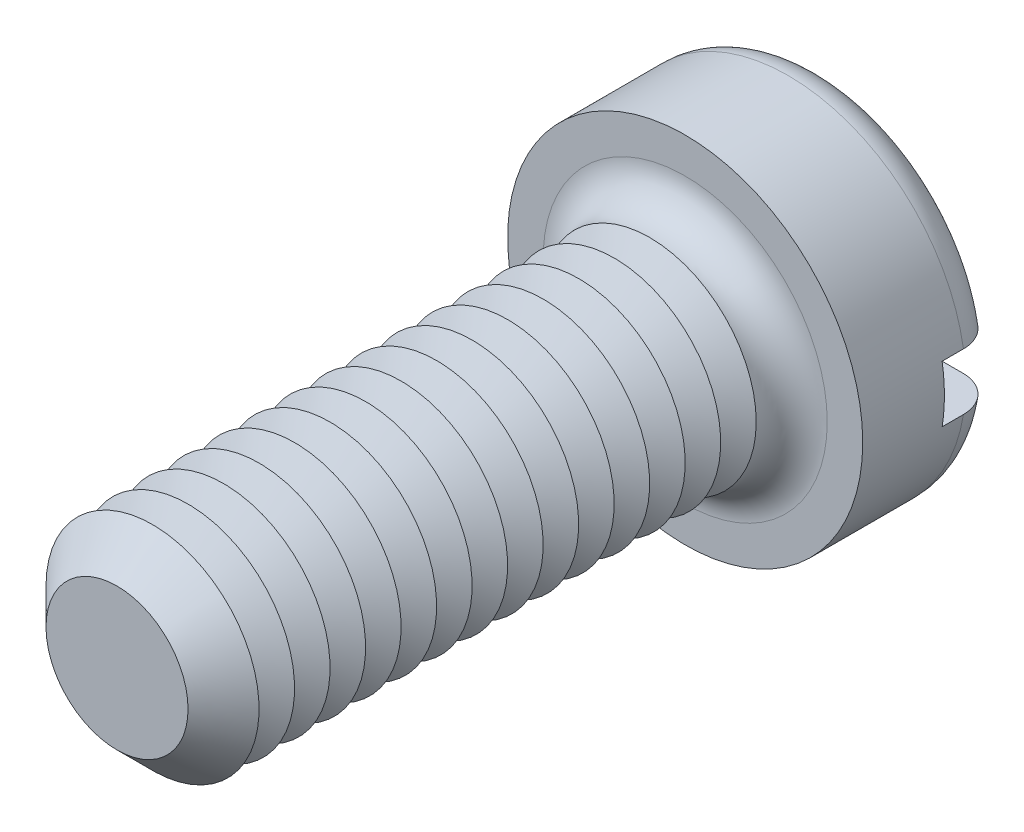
ISO-10303-21;
HEADER;
FILE_DESCRIPTION(('STEP AP214'),'2;1');
FILE_NAME('part.step','',(''),(''),'','','');
FILE_SCHEMA(('AUTOMOTIVE_DESIGN { 1 0 10303 214 1 1 1 1 }'));
ENDSEC;
DATA;
#1=APPLICATION_CONTEXT('core data for automotive mechanical design processes');
#2=APPLICATION_PROTOCOL_DEFINITION('international standard','automotive_design',2000,#1);
#3=PRODUCT_CONTEXT('',#1,'mechanical');
#4=PRODUCT('Part','Part','',(#3));
#5=PRODUCT_RELATED_PRODUCT_CATEGORY('part','',(#4));
#6=PRODUCT_DEFINITION_FORMATION('','',#4);
#7=PRODUCT_DEFINITION_CONTEXT('part definition',#1,'design');
#8=PRODUCT_DEFINITION('design','',#6,#7);
#9=PRODUCT_DEFINITION_SHAPE('','',#8);
#10=(LENGTH_UNIT() NAMED_UNIT(*) SI_UNIT(.MILLI.,.METRE.));
#11=(NAMED_UNIT(*) PLANE_ANGLE_UNIT() SI_UNIT($,.RADIAN.));
#12=(NAMED_UNIT(*) SI_UNIT($,.STERADIAN.) SOLID_ANGLE_UNIT());
#13=UNCERTAINTY_MEASURE_WITH_UNIT(LENGTH_MEASURE(1.E-05),#10,'distance_accuracy_value','');
#14=(GEOMETRIC_REPRESENTATION_CONTEXT(3) GLOBAL_UNCERTAINTY_ASSIGNED_CONTEXT((#13)) GLOBAL_UNIT_ASSIGNED_CONTEXT((#10,
#11,#12)) REPRESENTATION_CONTEXT('',''));
#15=CARTESIAN_POINT('',(0.,0.,0.));
#16=DIRECTION('',(0.,0.,1.));
#17=DIRECTION('',(1.,0.,0.));
#18=AXIS2_PLACEMENT_3D('',#15,#16,#17);
#19=CARTESIAN_POINT('',(0.,0.,-3.9));
#20=DIRECTION('',(0.,0.,1.));
#21=DIRECTION('',(1.,0.,0.));
#22=AXIS2_PLACEMENT_3D('',#19,#20,#21);
#23=PLANE('',#22);
#24=CARTESIAN_POINT('',(0.,0.,-3.9));
#25=DIRECTION('',(0.,0.,1.));
#26=DIRECTION('',(1.,0.,0.));
#27=AXIS2_PLACEMENT_3D('',#24,#25,#26);
#28=CIRCLE('',#27,4.);
#29=CARTESIAN_POINT('',(-3.91918358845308,0.800000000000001,-3.9));
#30=VERTEX_POINT('',#29);
#31=CARTESIAN_POINT('',(3.91918358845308,0.8,-3.9));
#32=VERTEX_POINT('',#31);
#33=EDGE_CURVE('E116',#30,#32,#28,.F.);
#34=ORIENTED_EDGE('',*,*,#33,.T.);
#35=DIRECTION('',(1.,0.,0.));
#36=VECTOR('',#35,1.);
#37=CARTESIAN_POINT('',(-5.,0.800000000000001,-3.9));
#38=LINE('',#37,#36);
#39=EDGE_CURVE('E111',#30,#32,#38,.T.);
#40=ORIENTED_EDGE('',*,*,#39,.F.);
#41=EDGE_LOOP('',(#34,#40));
#42=FACE_BOUND('',#41,.T.);
#43=ADVANCED_FACE('F39',(#42),#23,.F.);
#44=CARTESIAN_POINT('',(0.,0.,-2.9));
#45=DIRECTION('',(0.,0.,1.));
#46=DIRECTION('',(1.,0.,0.));
#47=AXIS2_PLACEMENT_3D('',#44,#45,#46);
#48=TOROIDAL_SURFACE('',#47,4.,1.);
#49=CARTESIAN_POINT('',(-4.76648512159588,0.800000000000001,-3.45304061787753));
#50=CARTESIAN_POINT('',(-4.73486405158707,0.800000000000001,-3.50001565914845));
#51=CARTESIAN_POINT('',(-4.69920787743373,0.800000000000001,-3.54432871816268));
#52=CARTESIAN_POINT('',(-4.62090302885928,0.800000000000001,-3.62634638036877));
#53=CARTESIAN_POINT('',(-4.57824494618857,0.800000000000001,-3.66404194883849));
#54=CARTESIAN_POINT('',(-4.48726975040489,0.800000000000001,-3.73172278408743));
#55=CARTESIAN_POINT('',(-4.43895902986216,0.800000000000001,-3.76171664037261));
#56=CARTESIAN_POINT('',(-4.33804923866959,0.800000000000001,-3.81326437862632));
#57=CARTESIAN_POINT('',(-4.2854512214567,0.800000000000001,-3.8348203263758));
#58=CARTESIAN_POINT('',(-4.17679895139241,0.800000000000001,-3.86918431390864));
#59=CARTESIAN_POINT('',(-4.12071163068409,0.800000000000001,-3.88188775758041));
#60=CARTESIAN_POINT('',(-4.00720729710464,0.800000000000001,-3.89785932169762));
#61=CARTESIAN_POINT('',(-3.94979011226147,0.800000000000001,-3.9011262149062));
#62=CARTESIAN_POINT('',(-3.83429042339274,0.800000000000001,-3.89816676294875));
#63=CARTESIAN_POINT('',(-3.77621176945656,0.800000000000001,-3.89178937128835));
#64=CARTESIAN_POINT('',(-3.66191938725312,0.800000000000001,-3.8694726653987));
#65=CARTESIAN_POINT('',(-3.60570580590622,0.800000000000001,-3.85353259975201));
#66=CARTESIAN_POINT('',(-3.49618749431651,0.800000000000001,-3.81233202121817));
#67=CARTESIAN_POINT('',(-3.44291561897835,0.800000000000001,-3.78698406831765));
#68=CARTESIAN_POINT('',(-3.34140774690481,0.800000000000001,-3.72766098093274));
#69=CARTESIAN_POINT('',(-3.29317182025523,0.800000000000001,-3.69368572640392));
#70=CARTESIAN_POINT('',(-3.20343355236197,0.800000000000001,-3.6182054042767));
#71=CARTESIAN_POINT('',(-3.16189680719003,0.800000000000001,-3.57674128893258));
#72=CARTESIAN_POINT('',(-3.08658236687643,0.800000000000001,-3.48727547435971));
#73=CARTESIAN_POINT('',(-3.05280364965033,0.800000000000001,-3.43927463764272));
#74=CARTESIAN_POINT('',(-2.99489532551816,0.800000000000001,-3.33932895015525));
#75=CARTESIAN_POINT('',(-2.97055012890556,0.800000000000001,-3.28750911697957));
#76=CARTESIAN_POINT('',(-2.93124252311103,0.800000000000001,-3.18042600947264));
#77=CARTESIAN_POINT('',(-2.91627793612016,0.800000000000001,-3.12516353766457));
#78=CARTESIAN_POINT('',(-2.89663075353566,0.800000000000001,-3.01470560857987));
#79=CARTESIAN_POINT('',(-2.89162828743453,0.800000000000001,-2.95956691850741));
#80=CARTESIAN_POINT('',(-2.89112479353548,0.800000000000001,-2.84924961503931));
#81=CARTESIAN_POINT('',(-2.89562264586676,0.800000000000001,-2.79407100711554));
#82=CARTESIAN_POINT('',(-2.91379565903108,0.800000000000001,-2.6861912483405));
#83=CARTESIAN_POINT('',(-2.92731815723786,0.800000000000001,-2.63346424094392));
#84=CARTESIAN_POINT('',(-2.96290888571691,0.800000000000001,-2.53098203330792));
#85=CARTESIAN_POINT('',(-2.98497757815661,0.800000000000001,-2.48122699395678));
#86=CARTESIAN_POINT('',(-3.03728055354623,0.800000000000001,-2.38535286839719));
#87=CARTESIAN_POINT('',(-3.06761989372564,0.800000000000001,-2.33929117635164));
#88=CARTESIAN_POINT('',(-3.13537950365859,0.800000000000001,-2.2527125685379));
#89=CARTESIAN_POINT('',(-3.17280082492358,0.800000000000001,-2.21219647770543));
#90=CARTESIAN_POINT('',(-3.2549164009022,0.800000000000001,-2.13651195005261));
#91=CARTESIAN_POINT('',(-3.29980186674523,0.800000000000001,-2.10155095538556));
#92=CARTESIAN_POINT('',(-3.39467666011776,0.800000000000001,-2.03942270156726));
#93=CARTESIAN_POINT('',(-3.44466673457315,0.800000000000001,-2.01225658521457));
#94=CARTESIAN_POINT('',(-3.5497933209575,0.800000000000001,-1.96576935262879));
#95=CARTESIAN_POINT('',(-3.60503228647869,0.800000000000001,-1.94667963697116));
#96=CARTESIAN_POINT('',(-3.71791613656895,0.800000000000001,-1.91794308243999));
#97=CARTESIAN_POINT('',(-3.77556119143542,0.800000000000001,-1.90829691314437));
#98=CARTESIAN_POINT('',(-3.89221522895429,0.800000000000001,-1.89869331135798));
#99=CARTESIAN_POINT('',(-3.9512319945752,0.800000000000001,-1.89882985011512));
#100=CARTESIAN_POINT('',(-4.06839541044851,0.800000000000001,-1.90907818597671));
#101=CARTESIAN_POINT('',(-4.12654207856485,0.800000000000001,-1.91918977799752));
#102=CARTESIAN_POINT('',(-4.23988103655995,0.800000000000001,-1.9490667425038));
#103=CARTESIAN_POINT('',(-4.29509069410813,0.800000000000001,-1.96876615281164));
#104=CARTESIAN_POINT('',(-4.40134194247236,0.800000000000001,-2.01729572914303));
#105=CARTESIAN_POINT('',(-4.45238383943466,0.800000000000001,-2.04612522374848));
#106=CARTESIAN_POINT('',(-4.54801343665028,0.800000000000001,-2.1116316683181));
#107=CARTESIAN_POINT('',(-4.59268768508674,0.800000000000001,-2.14818225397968));
#108=CARTESIAN_POINT('',(-4.67513924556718,0.800000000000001,-2.22837632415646));
#109=CARTESIAN_POINT('',(-4.71291715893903,0.800000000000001,-2.27201918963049));
#110=CARTESIAN_POINT('',(-4.77986554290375,0.800000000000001,-2.36439990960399));
#111=CARTESIAN_POINT('',(-4.80916462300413,0.800000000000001,-2.41304457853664));
#112=CARTESIAN_POINT('',(-4.85906149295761,0.800000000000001,-2.51460659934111));
#113=CARTESIAN_POINT('',(-4.8796602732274,0.800000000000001,-2.56752346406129));
#114=CARTESIAN_POINT('',(-4.9113264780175,0.800000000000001,-2.67542592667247));
#115=CARTESIAN_POINT('',(-4.92250819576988,0.800000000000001,-2.73037800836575));
#116=CARTESIAN_POINT('',(-4.93542682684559,0.800000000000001,-2.84139649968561));
#117=CARTESIAN_POINT('',(-4.93716171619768,0.800000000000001,-2.89746314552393));
#118=CARTESIAN_POINT('',(-4.93114851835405,0.800000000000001,-3.00876455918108));
#119=CARTESIAN_POINT('',(-4.92345325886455,0.800000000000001,-3.0640022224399));
#120=CARTESIAN_POINT('',(-4.8989032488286,0.800000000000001,-3.17235240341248));
#121=CARTESIAN_POINT('',(-4.88205998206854,0.800000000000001,-3.22546749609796));
#122=CARTESIAN_POINT('',(-4.84819200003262,0.800000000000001,-3.30764066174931));
#123=CARTESIAN_POINT('',(-4.83390853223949,0.800000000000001,-3.33785845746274));
#124=CARTESIAN_POINT('',(-4.80237957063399,0.800000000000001,-3.39670633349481));
#125=CARTESIAN_POINT('',(-4.78513409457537,0.800000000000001,-3.42533642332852));
#126=CARTESIAN_POINT('',(-4.76648512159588,0.800000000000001,-3.45304061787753));
#127=B_SPLINE_CURVE_WITH_KNOTS('',3,(#49,#50,#51,#52,#53,#54,#55,#56,#57,#58,#59,#60,#61,#62,
#63,#64,#65,#66,#67,#68,#69,#70,#71,#72,#73,#74,#75,#76,#77,#78,#79,#80,#81,#82,#83,#84,#85,#86,
#87,#88,#89,#90,#91,#92,#93,#94,#95,#96,#97,#98,#99,#100,#101,#102,#103,#104,#105,#106,#107,
#108,#109,#110,#111,#112,#113,#114,#115,#116,#117,#118,#119,#120,#121,#122,#123,#124,#125,#126),
.UNSPECIFIED.,.T.,.F.,(4,2,2,2,2,2,2,2,2,2,2,2,2,2,2,2,2,2,2,2,2,2,2,2,2,2,2,2,2,2,2,2,2,2,2,2,
2,2,4),(0.,0.169755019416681,0.339740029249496,0.509534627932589,0.67928763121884,
0.851013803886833,1.02276230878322,1.19722869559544,1.37170879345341,1.54785292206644,
1.72399950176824,1.89921049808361,2.07439839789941,2.24530597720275,2.41617386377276,
2.58146078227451,2.74672821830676,2.90926852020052,3.0718176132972,3.2365363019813,
3.40127946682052,3.57118676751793,3.74111896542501,3.91563534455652,4.09016409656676,
4.26636956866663,4.4425714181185,4.61757781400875,4.79257134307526,4.96489650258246,
5.13720662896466,5.30674670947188,5.47626748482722,5.64369988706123,5.81116816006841,
5.97770254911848,6.14402836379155,6.24414438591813,6.34425980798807),.UNSPECIFIED.);
#128=CARTESIAN_POINT('',(-4.93558507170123,0.800000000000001,-2.9));
#129=VERTEX_POINT('',#128);
#130=EDGE_CURVE('E290',#129,#30,#127,.T.);
#131=ORIENTED_EDGE('',*,*,#130,.F.);
#132=CARTESIAN_POINT('',(0.,0.,-2.9));
#133=DIRECTION('',(0.,0.,1.));
#134=DIRECTION('',(1.,0.,0.));
#135=AXIS2_PLACEMENT_3D('',#132,#133,#134);
#136=CIRCLE('',#135,5.);
#137=CARTESIAN_POINT('',(4.93558507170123,0.8,-2.9));
#138=VERTEX_POINT('',#137);
#139=EDGE_CURVE('E124',#138,#129,#136,.T.);
#140=ORIENTED_EDGE('',*,*,#139,.F.);
#141=CARTESIAN_POINT('',(2.98553785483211,0.8,-3.31649797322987));
#142=CARTESIAN_POINT('',(3.00991125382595,0.8,-3.36788093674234));
#143=CARTESIAN_POINT('',(3.03875556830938,0.8,-3.41719756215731));
#144=CARTESIAN_POINT('',(3.1043993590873,0.8,-3.51028676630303));
#145=CARTESIAN_POINT('',(3.1412115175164,0.8,-3.55405032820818));
#146=CARTESIAN_POINT('',(3.22153641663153,0.8,-3.63476402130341));
#147=CARTESIAN_POINT('',(3.26503706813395,0.8,-3.67172618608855));
#148=CARTESIAN_POINT('',(3.35749627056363,0.8,-3.73799476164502));
#149=CARTESIAN_POINT('',(3.4064533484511,0.8,-3.76730323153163));
#150=CARTESIAN_POINT('',(3.5095773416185,0.8,-3.81809642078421));
#151=CARTESIAN_POINT('',(3.56383317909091,0.8,-3.83940072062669));
#152=CARTESIAN_POINT('',(3.67513017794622,0.8,-3.87272481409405));
#153=CARTESIAN_POINT('',(3.7321717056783,0.8,-3.88474338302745));
#154=CARTESIAN_POINT('',(3.84815688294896,0.8,-3.89923413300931));
#155=CARTESIAN_POINT('',(3.90711516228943,0.8,-3.9015896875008));
#156=CARTESIAN_POINT('',(4.02458610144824,0.8,-3.89631753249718));
#157=CARTESIAN_POINT('',(4.08309876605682,0.8,-3.8886899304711));
#158=CARTESIAN_POINT('',(4.19768646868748,0.8,-3.86366584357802));
#159=CARTESIAN_POINT('',(4.25377243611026,0.8,-3.84631948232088));
#160=CARTESIAN_POINT('',(4.3621676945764,0.8,-3.80231797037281));
#161=CARTESIAN_POINT('',(4.41447726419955,0.8,-3.77566350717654));
#162=CARTESIAN_POINT('',(4.51300872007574,0.8,-3.71421163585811));
#163=CARTESIAN_POINT('',(4.5593085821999,0.8,-3.67953927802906));
#164=CARTESIAN_POINT('',(4.64530675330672,0.8,-3.60279495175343));
#165=CARTESIAN_POINT('',(4.68500564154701,0.8,-3.56072363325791));
#166=CARTESIAN_POINT('',(4.75599202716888,0.8,-3.47111750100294));
#167=CARTESIAN_POINT('',(4.7874061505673,0.8,-3.42368298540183));
#168=CARTESIAN_POINT('',(4.84170328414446,0.8,-3.32415927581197));
#169=CARTESIAN_POINT('',(4.86458695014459,0.8,-3.2720704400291));
#170=CARTESIAN_POINT('',(4.90088120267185,0.8,-3.16544016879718));
#171=CARTESIAN_POINT('',(4.91440984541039,0.8,-3.11093889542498));
#172=CARTESIAN_POINT('',(4.93205429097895,0.8,-3.00043391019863));
#173=CARTESIAN_POINT('',(4.93617053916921,0.8,-2.9444302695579));
#174=CARTESIAN_POINT('',(4.93486973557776,0.8,-2.83292218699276));
#175=CARTESIAN_POINT('',(4.92951827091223,0.8,-2.77741696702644));
#176=CARTESIAN_POINT('',(4.90957104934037,0.8,-2.66809456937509));
#177=CARTESIAN_POINT('',(4.89497541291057,0.8,-2.61427736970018));
#178=CARTESIAN_POINT('',(4.85697876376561,0.8,-2.50985095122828));
#179=CARTESIAN_POINT('',(4.83357805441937,0.8,-2.45924162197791));
#180=CARTESIAN_POINT('',(4.77866660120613,0.8,-2.36263484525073));
#181=CARTESIAN_POINT('',(4.74715567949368,0.8,-2.31663749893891));
#182=CARTESIAN_POINT('',(4.67670791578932,0.8,-2.23021464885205));
#183=CARTESIAN_POINT('',(4.6377224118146,0.8,-2.1898288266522));
#184=CARTESIAN_POINT('',(4.55359880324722,0.8,-2.11607828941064));
#185=CARTESIAN_POINT('',(4.50846036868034,0.8,-2.08271395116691));
#186=CARTESIAN_POINT('',(4.41271544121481,0.8,-2.02349513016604));
#187=CARTESIAN_POINT('',(4.36204749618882,0.8,-1.99774003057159));
#188=CARTESIAN_POINT('',(4.257155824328,0.8,-1.95495040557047));
#189=CARTESIAN_POINT('',(4.20293181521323,0.8,-1.93791657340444));
#190=CARTESIAN_POINT('',(4.09154156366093,0.8,-1.91276335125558));
#191=CARTESIAN_POINT('',(4.03434212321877,0.8,-1.90479098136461));
#192=CARTESIAN_POINT('',(3.91941228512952,0.8,-1.89840884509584));
#193=CARTESIAN_POINT('',(3.8616818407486,0.8,-1.89999992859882));
#194=CARTESIAN_POINT('',(3.7464111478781,0.8,-1.91275144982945));
#195=CARTESIAN_POINT('',(3.6888866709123,0.8,-1.92405471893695));
#196=CARTESIAN_POINT('',(3.57652290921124,0.8,-1.95609086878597));
#197=CARTESIAN_POINT('',(3.52168382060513,0.8,-1.97682443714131));
#198=CARTESIAN_POINT('',(3.41589179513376,0.8,-2.02733294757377));
#199=CARTESIAN_POINT('',(3.36496676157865,0.8,-2.05716640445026));
#200=CARTESIAN_POINT('',(3.26890903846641,0.8,-2.12504079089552));
#201=CARTESIAN_POINT('',(3.22377627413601,0.8,-2.16308161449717));
#202=CARTESIAN_POINT('',(3.141135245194,0.8,-2.24593284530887));
#203=CARTESIAN_POINT('',(3.1035541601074,0.8,-2.29067053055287));
#204=CARTESIAN_POINT('',(3.03669700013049,0.8,-2.38597317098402));
#205=CARTESIAN_POINT('',(3.00741914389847,0.8,-2.43653687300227));
#206=CARTESIAN_POINT('',(2.95891799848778,0.8,-2.54052959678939));
#207=CARTESIAN_POINT('',(2.93943249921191,0.8,-2.59383627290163));
#208=CARTESIAN_POINT('',(2.9100081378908,0.8,-2.70303736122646));
#209=CARTESIAN_POINT('',(2.90006970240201,0.8,-2.75893188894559));
#210=CARTESIAN_POINT('',(2.89027863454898,0.8,-2.86986958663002));
#211=CARTESIAN_POINT('',(2.89012791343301,0.8,-2.92488680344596));
#212=CARTESIAN_POINT('',(2.89917145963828,0.8,-3.03409648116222));
#213=CARTESIAN_POINT('',(2.90835313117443,0.8,-3.08828995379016));
#214=CARTESIAN_POINT('',(2.92977618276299,0.8,-3.17141652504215));
#215=CARTESIAN_POINT('',(2.93899011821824,0.8,-3.20116372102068));
#216=CARTESIAN_POINT('',(2.96020249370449,0.8,-3.25964614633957));
#217=CARTESIAN_POINT('',(2.97220082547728,0.8,-3.28838141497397));
#218=CARTESIAN_POINT('',(2.98553785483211,0.8,-3.31649797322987));
#219=B_SPLINE_CURVE_WITH_KNOTS('',3,(#141,#142,#143,#144,#145,#146,#147,#148,#149,#150,#151,
#152,#153,#154,#155,#156,#157,#158,#159,#160,#161,#162,#163,#164,#165,#166,#167,#168,#169,#170,
#171,#172,#173,#174,#175,#176,#177,#178,#179,#180,#181,#182,#183,#184,#185,#186,#187,#188,#189,
#190,#191,#192,#193,#194,#195,#196,#197,#198,#199,#200,#201,#202,#203,#204,#205,#206,#207,#208,
#209,#210,#211,#212,#213,#214,#215,#216,#217,#218),.UNSPECIFIED.,.T.,.F.,(4,2,2,2,2,2,2,2,2,2,2,
2,2,2,2,2,2,2,2,2,2,2,2,2,2,2,2,2,2,2,2,2,2,2,2,2,2,2,4),(0.,0.170493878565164,
0.341261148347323,0.511723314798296,0.682139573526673,0.856194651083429,1.03027268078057,
1.20644565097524,1.38261672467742,1.55788746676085,1.73314526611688,1.90583484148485,
2.07850925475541,2.24836742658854,2.41821253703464,2.58587311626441,2.75352576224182,
2.92002154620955,3.08651516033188,3.25300303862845,3.41949456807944,3.58710926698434,
3.75473295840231,3.92445790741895,4.09419634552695,4.26665110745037,4.43912119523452,
4.61417197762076,4.78923552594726,4.96544940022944,5.1416609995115,5.31608191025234,
5.49046537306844,5.65989063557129,5.82932346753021,5.99359365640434,6.157642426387,
6.250939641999,6.34423323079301),.UNSPECIFIED.);
#220=EDGE_CURVE('E292',#32,#138,#219,.T.);
#221=ORIENTED_EDGE('',*,*,#220,.F.);
#222=ORIENTED_EDGE('',*,*,#33,.F.);
#223=EDGE_LOOP('',(#131,#140,#221,#222));
#224=FACE_BOUND('',#223,.T.);
#225=ADVANCED_FACE('F274',(#224),#48,.T.);
#226=CARTESIAN_POINT('',(0.,0.,-3.9));
#227=DIRECTION('',(0.,0.,1.));
#228=DIRECTION('',(1.,0.,0.));
#229=AXIS2_PLACEMENT_3D('',#226,#227,#228);
#230=CYLINDRICAL_SURFACE('',#229,5.);
#231=DIRECTION('',(0.,0.,1.));
#232=VECTOR('',#231,1.);
#233=CARTESIAN_POINT('',(4.93558507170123,0.8,-3.9));
#234=LINE('',#233,#232);
#235=CARTESIAN_POINT('',(4.93558507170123,0.8,-2.3));
#236=VERTEX_POINT('',#235);
#237=EDGE_CURVE('E306',#138,#236,#234,.T.);
#238=ORIENTED_EDGE('',*,*,#237,.F.);
#239=ORIENTED_EDGE('',*,*,#139,.T.);
#240=DIRECTION('',(0.,0.,1.));
#241=VECTOR('',#240,1.);
#242=CARTESIAN_POINT('',(-4.93558507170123,0.800000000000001,-3.9));
#243=LINE('',#242,#241);
#244=CARTESIAN_POINT('',(-4.93558507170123,0.800000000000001,-2.3));
#245=VERTEX_POINT('',#244);
#246=EDGE_CURVE('E63',#245,#129,#243,.F.);
#247=ORIENTED_EDGE('',*,*,#246,.F.);
#248=CARTESIAN_POINT('',(0.,0.,-2.3));
#249=DIRECTION('',(0.,0.,-1.));
#250=DIRECTION('',(-1.,0.,0.));
#251=AXIS2_PLACEMENT_3D('',#248,#249,#250);
#252=CIRCLE('',#251,5.);
#253=CARTESIAN_POINT('',(-4.93558507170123,-0.799999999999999,-2.3));
#254=VERTEX_POINT('',#253);
#255=EDGE_CURVE('E43',#245,#254,#252,.F.);
#256=ORIENTED_EDGE('',*,*,#255,.T.);
#257=DIRECTION('',(0.,0.,1.));
#258=VECTOR('',#257,1.);
#259=CARTESIAN_POINT('',(-4.93558507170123,-0.799999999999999,-3.9));
#260=LINE('',#259,#258);
#261=CARTESIAN_POINT('',(-4.93558507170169,-0.799999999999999,-2.89999999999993));
#262=VERTEX_POINT('',#261);
#263=EDGE_CURVE('E304',#262,#254,#260,.T.);
#264=ORIENTED_EDGE('',*,*,#263,.F.);
#265=CARTESIAN_POINT('',(4.93558507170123,-0.8,-2.9));
#266=VERTEX_POINT('',#265);
#267=EDGE_CURVE('E126',#262,#266,#136,.T.);
#268=ORIENTED_EDGE('',*,*,#267,.T.);
#269=DIRECTION('',(0.,0.,1.));
#270=VECTOR('',#269,1.);
#271=CARTESIAN_POINT('',(4.93558507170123,-0.8,-3.9));
#272=LINE('',#271,#270);
#273=CARTESIAN_POINT('',(4.93558507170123,-0.8,-2.3));
#274=VERTEX_POINT('',#273);
#275=EDGE_CURVE('E55',#274,#266,#272,.F.);
#276=ORIENTED_EDGE('',*,*,#275,.F.);
#277=EDGE_CURVE('E11',#274,#236,#252,.F.);
#278=ORIENTED_EDGE('',*,*,#277,.T.);
#279=EDGE_LOOP('',(#238,#239,#247,#256,#264,#268,#276,#278));
#280=FACE_BOUND('',#279,.T.);
#281=CARTESIAN_POINT('',(0.,0.,0.));
#282=DIRECTION('',(0.,0.,1.));
#283=DIRECTION('',(1.,0.,0.));
#284=AXIS2_PLACEMENT_3D('',#281,#282,#283);
#285=CIRCLE('',#284,5.);
#286=CARTESIAN_POINT('',(5.,0.,0.));
#287=VERTEX_POINT('',#286);
#288=EDGE_CURVE('E309',#287,#287,#285,.T.);
#289=ORIENTED_EDGE('',*,*,#288,.F.);
#290=EDGE_LOOP('',(#289));
#291=FACE_BOUND('',#290,.T.);
#292=ADVANCED_FACE('F270',(#280,#291),#230,.T.);
#293=CARTESIAN_POINT('',(3.91918358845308,-0.8,-3.9));
#294=VERTEX_POINT('',#293);
#295=CARTESIAN_POINT('',(-3.91918358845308,-0.799999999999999,-3.9));
#296=VERTEX_POINT('',#295);
#297=EDGE_CURVE('E109',#294,#296,#28,.F.);
#298=ORIENTED_EDGE('',*,*,#297,.T.);
#299=DIRECTION('',(-1.,0.,0.));
#300=VECTOR('',#299,1.);
#301=CARTESIAN_POINT('',(-5.,-0.799999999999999,-3.9));
#302=LINE('',#301,#300);
#303=EDGE_CURVE('E96',#294,#296,#302,.T.);
#304=ORIENTED_EDGE('',*,*,#303,.F.);
#305=EDGE_LOOP('',(#298,#304));
#306=FACE_BOUND('',#305,.T.);
#307=ADVANCED_FACE('F108',(#306),#23,.F.);
#308=CARTESIAN_POINT('',(0.,0.,0.));
#309=DIRECTION('',(0.,0.,1.));
#310=DIRECTION('',(1.,0.,0.));
#311=AXIS2_PLACEMENT_3D('',#308,#309,#310);
#312=PLANE('',#311);
#313=CARTESIAN_POINT('',(0.,0.,0.));
#314=DIRECTION('',(0.,0.,1.));
#315=DIRECTION('',(1.,0.,0.));
#316=AXIS2_PLACEMENT_3D('',#313,#314,#315);
#317=CIRCLE('',#316,4.);
#318=CARTESIAN_POINT('',(4.,0.,0.));
#319=VERTEX_POINT('',#318);
#320=EDGE_CURVE('E115',#319,#319,#317,.F.);
#321=ORIENTED_EDGE('',*,*,#320,.T.);
#322=EDGE_LOOP('',(#321));
#323=FACE_BOUND('',#322,.T.);
#324=ORIENTED_EDGE('',*,*,#288,.T.);
#325=EDGE_LOOP('',(#324));
#326=FACE_BOUND('',#325,.T.);
#327=ADVANCED_FACE('F269',(#323,#326),#312,.T.);
#328=CARTESIAN_POINT('',(-4.76648512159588,-0.799999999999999,-3.45304061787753));
#329=CARTESIAN_POINT('',(-4.7975694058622,-0.799999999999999,-3.40685392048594));
#330=CARTESIAN_POINT('',(-4.82479903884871,-0.799999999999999,-3.35802740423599));
#331=CARTESIAN_POINT('',(-4.87070632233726,-0.799999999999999,-3.25646127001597));
#332=CARTESIAN_POINT('',(-4.8893747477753,-0.799999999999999,-3.20371750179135));
#333=CARTESIAN_POINT('',(-4.91756720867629,-0.799999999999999,-3.09584501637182));
#334=CARTESIAN_POINT('',(-4.92709302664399,-0.799999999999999,-3.04071676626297));
#335=CARTESIAN_POINT('',(-4.93671217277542,-0.799999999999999,-2.92965669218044));
#336=CARTESIAN_POINT('',(-4.93680767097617,-0.799999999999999,-2.87372505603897));
#337=CARTESIAN_POINT('',(-4.92758675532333,-0.799999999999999,-2.76284675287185));
#338=CARTESIAN_POINT('',(-4.91830421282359,-0.799999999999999,-2.70789726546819));
#339=CARTESIAN_POINT('',(-4.89065741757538,-0.799999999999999,-2.60033228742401));
#340=CARTESIAN_POINT('',(-4.87229291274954,-0.799999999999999,-2.54771686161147));
#341=CARTESIAN_POINT('',(-4.82699855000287,-0.799999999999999,-2.44622441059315));
#342=CARTESIAN_POINT('',(-4.80005659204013,-0.799999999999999,-2.39735278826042));
#343=CARTESIAN_POINT('',(-4.73841244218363,-0.799999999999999,-2.30477947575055));
#344=CARTESIAN_POINT('',(-4.70371003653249,-0.799999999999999,-2.26107792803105));
#345=CARTESIAN_POINT('',(-4.62724516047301,-0.799999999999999,-2.17969334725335));
#346=CARTESIAN_POINT('',(-4.58542787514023,-0.799999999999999,-2.14206183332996));
#347=CARTESIAN_POINT('',(-4.49614171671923,-0.799999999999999,-2.07424284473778));
#348=CARTESIAN_POINT('',(-4.44867251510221,-0.799999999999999,-2.04405580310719));
#349=CARTESIAN_POINT('',(-4.34875035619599,-0.799999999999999,-1.99153688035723));
#350=CARTESIAN_POINT('',(-4.29623870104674,-0.799999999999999,-1.96931670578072));
#351=CARTESIAN_POINT('',(-4.18826905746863,-0.799999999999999,-1.93384994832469));
#352=CARTESIAN_POINT('',(-4.1328108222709,-0.799999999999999,-1.92060411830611));
#353=CARTESIAN_POINT('',(-4.01956054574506,-0.799999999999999,-1.90323798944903));
#354=CARTESIAN_POINT('',(-3.96174522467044,-0.799999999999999,-1.89926947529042));
#355=CARTESIAN_POINT('',(-3.84625419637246,-0.799999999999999,-1.90095183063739));
#356=CARTESIAN_POINT('',(-3.78857850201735,-0.799999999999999,-1.90660355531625));
#357=CARTESIAN_POINT('',(-3.67415602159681,-0.799999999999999,-1.92748272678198));
#358=CARTESIAN_POINT('',(-3.61743328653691,-0.799999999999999,-1.94284216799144));
#359=CARTESIAN_POINT('',(-3.50734962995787,-0.799999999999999,-1.9828275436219));
#360=CARTESIAN_POINT('',(-3.4539889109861,-0.799999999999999,-2.00745403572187));
#361=CARTESIAN_POINT('',(-3.35197118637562,-0.799999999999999,-2.06542964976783));
#362=CARTESIAN_POINT('',(-3.30333217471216,-0.799999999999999,-2.0988104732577));
#363=CARTESIAN_POINT('',(-3.21244692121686,-0.799999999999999,-2.17337326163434));
#364=CARTESIAN_POINT('',(-3.17020039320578,-0.799999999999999,-2.21455487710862));
#365=CARTESIAN_POINT('',(-3.0940098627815,-0.799999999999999,-2.30296695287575));
#366=CARTESIAN_POINT('',(-3.05995540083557,-0.799999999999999,-2.35010211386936));
#367=CARTESIAN_POINT('',(-3.00053815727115,-0.799999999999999,-2.4495670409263));
#368=CARTESIAN_POINT('',(-2.97517362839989,-0.799999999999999,-2.50189576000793));
#369=CARTESIAN_POINT('',(-2.93470320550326,-0.799999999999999,-2.60853979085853));
#370=CARTESIAN_POINT('',(-2.91930557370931,-0.799999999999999,-2.66274437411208));
#371=CARTESIAN_POINT('',(-2.89812734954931,-0.799999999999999,-2.77299836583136));
#372=CARTESIAN_POINT('',(-2.89234481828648,-0.799999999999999,-2.82904740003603));
#373=CARTESIAN_POINT('',(-2.89064073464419,-0.799999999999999,-2.93970612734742));
#374=CARTESIAN_POINT('',(-2.89444549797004,-0.799999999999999,-2.99431180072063));
#375=CARTESIAN_POINT('',(-2.9112006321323,-0.799999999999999,-3.10209766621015));
#376=CARTESIAN_POINT('',(-2.9241507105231,-0.799999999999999,-3.1552779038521));
#377=CARTESIAN_POINT('',(-2.95868580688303,-0.799999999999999,-3.25858631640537));
#378=CARTESIAN_POINT('',(-2.98024709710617,-0.799999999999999,-3.30872244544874));
#379=CARTESIAN_POINT('',(-3.03128544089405,-0.799999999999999,-3.40478519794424));
#380=CARTESIAN_POINT('',(-3.06076335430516,-0.799999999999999,-3.45071136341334));
#381=CARTESIAN_POINT('',(-3.12753448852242,-0.799999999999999,-3.53826932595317));
#382=CARTESIAN_POINT('',(-3.16500083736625,-0.799999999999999,-3.57976901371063));
#383=CARTESIAN_POINT('',(-3.24617503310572,-0.799999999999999,-3.65613204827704));
#384=CARTESIAN_POINT('',(-3.28988388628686,-0.799999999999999,-3.69099432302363));
#385=CARTESIAN_POINT('',(-3.38380639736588,-0.799999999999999,-3.75424083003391));
#386=CARTESIAN_POINT('',(-3.43418287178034,-0.799999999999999,-3.78238342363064));
#387=CARTESIAN_POINT('',(-3.53887888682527,-0.799999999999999,-3.83000231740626));
#388=CARTESIAN_POINT('',(-3.59319889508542,-0.799999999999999,-3.84947758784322));
#389=CARTESIAN_POINT('',(-3.70539237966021,-0.799999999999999,-3.87954336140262));
#390=CARTESIAN_POINT('',(-3.76331464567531,-0.799999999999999,-3.88995217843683));
#391=CARTESIAN_POINT('',(-3.88008461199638,-0.799999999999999,-3.9009132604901));
#392=CARTESIAN_POINT('',(-3.93893230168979,-0.799999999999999,-3.9014656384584));
#393=CARTESIAN_POINT('',(-4.05594892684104,-0.799999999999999,-3.89264187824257));
#394=CARTESIAN_POINT('',(-4.11411702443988,-0.799999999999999,-3.88325457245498));
#395=CARTESIAN_POINT('',(-4.22802928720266,-0.799999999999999,-3.85472582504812));
#396=CARTESIAN_POINT('',(-4.28377297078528,-0.799999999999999,-3.83558245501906));
#397=CARTESIAN_POINT('',(-4.39054463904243,-0.799999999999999,-3.78829842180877));
#398=CARTESIAN_POINT('',(-4.44161887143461,-0.799999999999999,-3.76026208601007));
#399=CARTESIAN_POINT('',(-4.53818016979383,-0.799999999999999,-3.69589278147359));
#400=CARTESIAN_POINT('',(-4.58367442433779,-0.799999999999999,-3.65957066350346));
#401=CARTESIAN_POINT('',(-4.65208830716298,-0.799999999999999,-3.59453310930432));
#402=CARTESIAN_POINT('',(-4.67711825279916,-0.799999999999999,-3.56800018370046));
#403=CARTESIAN_POINT('',(-4.72414423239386,-0.799999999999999,-3.51236863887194));
#404=CARTESIAN_POINT('',(-4.74614029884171,-0.799999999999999,-3.48327004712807));
#405=CARTESIAN_POINT('',(-4.76648512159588,-0.799999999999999,-3.45304061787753));
#406=B_SPLINE_CURVE_WITH_KNOTS('',3,(#328,#329,#330,#331,#332,#333,#334,#335,#336,#337,#338,
#339,#340,#341,#342,#343,#344,#345,#346,#347,#348,#349,#350,#351,#352,#353,#354,#355,#356,#357,
#358,#359,#360,#361,#362,#363,#364,#365,#366,#367,#368,#369,#370,#371,#372,#373,#374,#375,#376,
#377,#378,#379,#380,#381,#382,#383,#384,#385,#386,#387,#388,#389,#390,#391,#392,#393,#394,#395,
#396,#397,#398,#399,#400,#401,#402,#403,#404,#405),.UNSPECIFIED.,.T.,.F.,(4,2,2,2,2,2,2,2,2,2,2,
2,2,2,2,2,2,2,2,2,2,2,2,2,2,2,2,2,2,2,2,2,2,2,2,2,2,2,4),(0.,0.166886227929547,
0.333951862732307,0.500984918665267,0.667979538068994,0.834373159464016,1.00077139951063,
1.16740542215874,1.33404403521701,1.50202999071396,1.67002571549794,1.84029248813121,
2.01057354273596,2.18362161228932,2.35668506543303,2.53215380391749,2.70763310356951,
2.88375684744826,3.05987270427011,3.23346085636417,3.40701408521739,3.57522519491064,
3.74340238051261,3.90683338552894,4.0702591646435,4.23323770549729,4.39623395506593,
4.56320691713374,4.7302068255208,4.90252468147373,5.07486300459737,5.25058028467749,
5.42629555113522,5.60220844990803,5.77815613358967,5.95211162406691,6.12584060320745,
6.23506966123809,6.34429754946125),.UNSPECIFIED.);
#407=EDGE_CURVE('E103',#296,#262,#406,.T.);
#408=ORIENTED_EDGE('',*,*,#407,.F.);
#409=ORIENTED_EDGE('',*,*,#297,.F.);
#410=CARTESIAN_POINT('',(2.98553785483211,-0.8,-3.31649797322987));
#411=CARTESIAN_POINT('',(2.96216773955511,-0.8,-3.26721849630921));
#412=CARTESIAN_POINT('',(2.94287503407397,-0.8,-3.21596872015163));
#413=CARTESIAN_POINT('',(2.91313258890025,-0.8,-3.11092723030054));
#414=CARTESIAN_POINT('',(2.9026902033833,-0.8,-3.0571334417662));
#415=CARTESIAN_POINT('',(2.89104377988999,-0.8,-2.94853922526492));
#416=CARTESIAN_POINT('',(2.88984130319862,-0.8,-2.89373862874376));
#417=CARTESIAN_POINT('',(2.89672585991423,-0.8,-2.78473646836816));
#418=CARTESIAN_POINT('',(2.90481120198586,-0.8,-2.73053479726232));
#419=CARTESIAN_POINT('',(2.92989134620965,-0.8,-2.62460092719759));
#420=CARTESIAN_POINT('',(2.94682969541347,-0.8,-2.57285532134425));
#421=CARTESIAN_POINT('',(2.9889990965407,-0.8,-2.47286425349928));
#422=CARTESIAN_POINT('',(3.01423103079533,-0.8,-2.42461916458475));
#423=CARTESIAN_POINT('',(3.07271536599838,-0.8,-2.33201565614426));
#424=CARTESIAN_POINT('',(3.10610710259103,-0.8,-2.28774532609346));
#425=CARTESIAN_POINT('',(3.17963417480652,-0.8,-2.205215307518));
#426=CARTESIAN_POINT('',(3.21977054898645,-0.8,-2.16695654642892));
#427=CARTESIAN_POINT('',(3.3070361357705,-0.8,-2.09624274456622));
#428=CARTESIAN_POINT('',(3.35434874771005,-0.8,-2.06401396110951));
#429=CARTESIAN_POINT('',(3.45361131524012,-0.8,-2.00773436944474));
#430=CARTESIAN_POINT('',(3.50556189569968,-0.8,-1.98368466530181));
#431=CARTESIAN_POINT('',(3.61398433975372,-0.8,-1.94389460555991));
#432=CARTESIAN_POINT('',(3.67053506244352,-0.8,-1.92836880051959));
#433=CARTESIAN_POINT('',(3.78543606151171,-0.8,-1.90696594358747));
#434=CARTESIAN_POINT('',(3.84378643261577,-0.8,-1.90108940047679));
#435=CARTESIAN_POINT('',(3.96100201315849,-0.8,-1.89918115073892));
#436=CARTESIAN_POINT('',(4.01986821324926,-0.8,-1.90320860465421));
#437=CARTESIAN_POINT('',(4.13606891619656,-0.8,-1.9211820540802));
#438=CARTESIAN_POINT('',(4.19340347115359,-0.8,-1.93512771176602));
#439=CARTESIAN_POINT('',(4.30434213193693,-0.8,-1.97243705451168));
#440=CARTESIAN_POINT('',(4.35797549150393,-0.8,-1.99571368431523));
#441=CARTESIAN_POINT('',(4.46048254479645,-0.8,-2.0510826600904));
#442=CARTESIAN_POINT('',(4.50935662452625,-0.8,-2.08317429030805));
#443=CARTESIAN_POINT('',(4.60012348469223,-0.8,-2.15471647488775));
#444=CARTESIAN_POINT('',(4.64211506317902,-0.8,-2.19404167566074));
#445=CARTESIAN_POINT('',(4.71877054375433,-0.8,-2.27928299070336));
#446=CARTESIAN_POINT('',(4.75343508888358,-0.8,-2.32519852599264));
#447=CARTESIAN_POINT('',(4.81388799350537,-0.8,-2.4215411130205));
#448=CARTESIAN_POINT('',(4.83980652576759,-0.8,-2.47188650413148));
#449=CARTESIAN_POINT('',(4.88271402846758,-0.8,-2.57624865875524));
#450=CARTESIAN_POINT('',(4.89970360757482,-0.8,-2.63026517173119));
#451=CARTESIAN_POINT('',(4.92409334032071,-0.8,-2.73978844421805));
#452=CARTESIAN_POINT('',(4.93159814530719,-0.8,-2.79527191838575));
#453=CARTESIAN_POINT('',(4.93713723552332,-0.8,-2.90670881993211));
#454=CARTESIAN_POINT('',(4.9351718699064,-0.8,-2.9626622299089));
#455=CARTESIAN_POINT('',(4.92186293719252,-0.8,-3.07317093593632));
#456=CARTESIAN_POINT('',(4.91056393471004,-0.8,-3.12773160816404));
#457=CARTESIAN_POINT('',(4.87898532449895,-0.8,-3.234187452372));
#458=CARTESIAN_POINT('',(4.85870572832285,-0.8,-3.28608262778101));
#459=CARTESIAN_POINT('',(4.80971634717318,-0.8,-3.38586723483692));
#460=CARTESIAN_POINT('',(4.78098824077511,-0.8,-3.43374766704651));
#461=CARTESIAN_POINT('',(4.71596686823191,-0.8,-3.52405937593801));
#462=CARTESIAN_POINT('',(4.67967336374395,-0.8,-3.56649048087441));
#463=CARTESIAN_POINT('',(4.60022577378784,-0.8,-3.64511036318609));
#464=CARTESIAN_POINT('',(4.5570143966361,-0.8,-3.6812412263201));
#465=CARTESIAN_POINT('',(4.4652099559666,-0.8,-3.7458530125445));
#466=CARTESIAN_POINT('',(4.41661654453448,-0.8,-3.77433344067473));
#467=CARTESIAN_POINT('',(4.31470683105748,-0.8,-3.82326981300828));
#468=CARTESIAN_POINT('',(4.26133399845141,-0.8,-3.84360800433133));
#469=CARTESIAN_POINT('',(4.15196444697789,-0.8,-3.87519515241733));
#470=CARTESIAN_POINT('',(4.09596750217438,-0.8,-3.88644332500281));
#471=CARTESIAN_POINT('',(3.98196469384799,-0.8,-3.89971870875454));
#472=CARTESIAN_POINT('',(3.92394096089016,-0.8,-3.901592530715));
#473=CARTESIAN_POINT('',(3.8083852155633,-0.8,-3.89570840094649));
#474=CARTESIAN_POINT('',(3.75085322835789,-0.8,-3.88794995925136));
#475=CARTESIAN_POINT('',(3.6371167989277,-0.8,-3.86287824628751));
#476=CARTESIAN_POINT('',(3.58093962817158,-0.8,-3.84544111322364));
#477=CARTESIAN_POINT('',(3.47227948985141,-0.8,-3.80139971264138));
#478=CARTESIAN_POINT('',(3.41979762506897,-0.8,-3.77479272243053));
#479=CARTESIAN_POINT('',(3.31994061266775,-0.8,-3.71304199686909));
#480=CARTESIAN_POINT('',(3.27257854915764,-0.8,-3.67787710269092));
#481=CARTESIAN_POINT('',(3.18459619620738,-0.8,-3.59999704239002));
#482=CARTESIAN_POINT('',(3.14396747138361,-0.8,-3.55729146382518));
#483=CARTESIAN_POINT('',(3.08341110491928,-0.8,-3.48140072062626));
#484=CARTESIAN_POINT('',(3.06118126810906,-0.8,-3.45002448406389));
#485=CARTESIAN_POINT('',(3.02047302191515,-0.8,-3.38492378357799));
#486=CARTESIAN_POINT('',(3.00199451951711,-0.8,-3.35119937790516));
#487=CARTESIAN_POINT('',(2.98553785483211,-0.8,-3.31649797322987));
#488=B_SPLINE_CURVE_WITH_KNOTS('',3,(#410,#411,#412,#413,#414,#415,#416,#417,#418,#419,#420,
#421,#422,#423,#424,#425,#426,#427,#428,#429,#430,#431,#432,#433,#434,#435,#436,#437,#438,#439,
#440,#441,#442,#443,#444,#445,#446,#447,#448,#449,#450,#451,#452,#453,#454,#455,#456,#457,#458,
#459,#460,#461,#462,#463,#464,#465,#466,#467,#468,#469,#470,#471,#472,#473,#474,#475,#476,#477,
#478,#479,#480,#481,#482,#483,#484,#485,#486,#487),.UNSPECIFIED.,.T.,.F.,(4,2,2,2,2,2,2,2,2,2,2,
2,2,2,2,2,2,2,2,2,2,2,2,2,2,2,2,2,2,2,2,2,2,2,2,2,2,2,4),(0.,0.163484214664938,
0.327104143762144,0.490751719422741,0.654369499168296,0.816956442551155,0.979560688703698,
1.14516376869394,1.31079237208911,1.48174839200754,1.6527274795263,1.82783306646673,
2.00294788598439,2.17911127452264,2.35526866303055,2.52981944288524,2.70435605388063,
2.87611266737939,3.04785420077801,3.21691347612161,3.38596122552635,3.55312700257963,
3.72028661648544,3.88665268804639,4.053018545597,4.2197478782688,4.38648246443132,
4.55467705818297,4.72288253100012,4.89343959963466,5.06401138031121,5.23736524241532,
5.41072792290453,5.58636211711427,5.76204850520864,5.93817375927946,6.11407667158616,
6.22920111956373,6.34432271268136),.UNSPECIFIED.);
#489=EDGE_CURVE('E92',#266,#294,#488,.T.);
#490=ORIENTED_EDGE('',*,*,#489,.F.);
#491=ORIENTED_EDGE('',*,*,#267,.F.);
#492=EDGE_LOOP('',(#408,#409,#490,#491));
#493=FACE_BOUND('',#492,.T.);
#494=ADVANCED_FACE('F113',(#493),#48,.T.);
#495=CARTESIAN_POINT('',(0.,0.,1.));
#496=DIRECTION('',(0.,0.,1.));
#497=DIRECTION('',(1.,0.,0.));
#498=AXIS2_PLACEMENT_3D('',#495,#496,#497);
#499=TOROIDAL_SURFACE('',#498,4.,1.);
#500=ORIENTED_EDGE('',*,*,#320,.F.);
#501=EDGE_LOOP('',(#500));
#502=FACE_BOUND('',#501,.T.);
#503=CARTESIAN_POINT('',(0.,0.,0.999999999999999));
#504=DIRECTION('',(0.,0.,-1.));
#505=DIRECTION('',(-1.,0.,0.));
#506=AXIS2_PLACEMENT_3D('',#503,#504,#505);
#507=CIRCLE('',#506,3.);
#508=CARTESIAN_POINT('',(-3.,0.,0.999999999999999));
#509=VERTEX_POINT('',#508);
#510=EDGE_CURVE('E315',#509,#509,#507,.T.);
#511=ORIENTED_EDGE('',*,*,#510,.T.);
#512=EDGE_LOOP('',(#511));
#513=FACE_BOUND('',#512,.T.);
#514=ADVANCED_FACE('F262',(#502,#513),#499,.F.);
#515=CARTESIAN_POINT('',(0.,0.,1.5));
#516=DIRECTION('',(0.,0.,-1.));
#517=DIRECTION('',(-1.,0.,0.));
#518=AXIS2_PLACEMENT_3D('',#515,#516,#517);
#519=CONICAL_SURFACE('',#518,2.13397459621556,1.0471975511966);
#520=ORIENTED_EDGE('',*,*,#510,.F.);
#521=EDGE_LOOP('',(#520));
#522=FACE_BOUND('',#521,.T.);
#523=CARTESIAN_POINT('',(0.,0.,1.5));
#524=DIRECTION('',(0.,0.,-1.));
#525=DIRECTION('',(-1.,0.,0.));
#526=AXIS2_PLACEMENT_3D('',#523,#524,#525);
#527=CIRCLE('',#526,2.13397459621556);
#528=CARTESIAN_POINT('',(-2.13397459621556,0.,1.5));
#529=VERTEX_POINT('',#528);
#530=EDGE_CURVE('E322',#529,#529,#527,.T.);
#531=ORIENTED_EDGE('',*,*,#530,.T.);
#532=EDGE_LOOP('',(#531));
#533=FACE_BOUND('',#532,.T.);
#534=ADVANCED_FACE('F258',(#522,#533),#519,.T.);
#535=CARTESIAN_POINT('',(0.,0.,2.));
#536=DIRECTION('',(0.,0.,1.));
#537=DIRECTION('',(1.,0.,0.));
#538=AXIS2_PLACEMENT_3D('',#535,#536,#537);
#539=CONICAL_SURFACE('',#538,3.,1.0471975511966);
#540=ORIENTED_EDGE('',*,*,#530,.F.);
#541=EDGE_LOOP('',(#540));
#542=FACE_BOUND('',#541,.T.);
#543=CARTESIAN_POINT('',(0.,0.,2.));
#544=DIRECTION('',(0.,0.,-1.));
#545=DIRECTION('',(-1.,0.,0.));
#546=AXIS2_PLACEMENT_3D('',#543,#544,#545);
#547=CIRCLE('',#546,3.);
#548=CARTESIAN_POINT('',(-3.,0.,2.));
#549=VERTEX_POINT('',#548);
#550=EDGE_CURVE('E328',#549,#549,#547,.T.);
#551=ORIENTED_EDGE('',*,*,#550,.T.);
#552=EDGE_LOOP('',(#551));
#553=FACE_BOUND('',#552,.T.);
#554=ADVANCED_FACE('F254',(#542,#553),#539,.T.);
#555=CARTESIAN_POINT('',(0.,0.,2.5));
#556=DIRECTION('',(0.,0.,-1.));
#557=DIRECTION('',(-1.,0.,0.));
#558=AXIS2_PLACEMENT_3D('',#555,#556,#557);
#559=CONICAL_SURFACE('',#558,2.13397459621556,1.0471975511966);
#560=ORIENTED_EDGE('',*,*,#550,.F.);
#561=EDGE_LOOP('',(#560));
#562=FACE_BOUND('',#561,.T.);
#563=CARTESIAN_POINT('',(0.,0.,2.5));
#564=DIRECTION('',(0.,0.,-1.));
#565=DIRECTION('',(-1.,0.,0.));
#566=AXIS2_PLACEMENT_3D('',#563,#564,#565);
#567=CIRCLE('',#566,2.13397459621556);
#568=CARTESIAN_POINT('',(-2.13397459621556,0.,2.5));
#569=VERTEX_POINT('',#568);
#570=EDGE_CURVE('E332',#569,#569,#567,.T.);
#571=ORIENTED_EDGE('',*,*,#570,.T.);
#572=EDGE_LOOP('',(#571));
#573=FACE_BOUND('',#572,.T.);
#574=ADVANCED_FACE('F250',(#562,#573),#559,.T.);
#575=CARTESIAN_POINT('',(0.,0.,3.));
#576=DIRECTION('',(0.,0.,1.));
#577=DIRECTION('',(1.,0.,0.));
#578=AXIS2_PLACEMENT_3D('',#575,#576,#577);
#579=CONICAL_SURFACE('',#578,3.,1.0471975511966);
#580=ORIENTED_EDGE('',*,*,#570,.F.);
#581=EDGE_LOOP('',(#580));
#582=FACE_BOUND('',#581,.T.);
#583=CARTESIAN_POINT('',(0.,0.,3.));
#584=DIRECTION('',(0.,0.,-1.));
#585=DIRECTION('',(-1.,0.,0.));
#586=AXIS2_PLACEMENT_3D('',#583,#584,#585);
#587=CIRCLE('',#586,3.);
#588=CARTESIAN_POINT('',(-3.,0.,3.));
#589=VERTEX_POINT('',#588);
#590=EDGE_CURVE('E336',#589,#589,#587,.T.);
#591=ORIENTED_EDGE('',*,*,#590,.T.);
#592=EDGE_LOOP('',(#591));
#593=FACE_BOUND('',#592,.T.);
#594=ADVANCED_FACE('F246',(#582,#593),#579,.T.);
#595=CARTESIAN_POINT('',(0.,0.,3.5));
#596=DIRECTION('',(0.,0.,-1.));
#597=DIRECTION('',(-1.,0.,0.));
#598=AXIS2_PLACEMENT_3D('',#595,#596,#597);
#599=CONICAL_SURFACE('',#598,2.13397459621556,1.0471975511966);
#600=ORIENTED_EDGE('',*,*,#590,.F.);
#601=EDGE_LOOP('',(#600));
#602=FACE_BOUND('',#601,.T.);
#603=CARTESIAN_POINT('',(0.,0.,3.5));
#604=DIRECTION('',(0.,0.,-1.));
#605=DIRECTION('',(-1.,0.,0.));
#606=AXIS2_PLACEMENT_3D('',#603,#604,#605);
#607=CIRCLE('',#606,2.13397459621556);
#608=CARTESIAN_POINT('',(-2.13397459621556,0.,3.5));
#609=VERTEX_POINT('',#608);
#610=EDGE_CURVE('E340',#609,#609,#607,.T.);
#611=ORIENTED_EDGE('',*,*,#610,.T.);
#612=EDGE_LOOP('',(#611));
#613=FACE_BOUND('',#612,.T.);
#614=ADVANCED_FACE('F242',(#602,#613),#599,.T.);
#615=CARTESIAN_POINT('',(0.,0.,4.));
#616=DIRECTION('',(0.,0.,1.));
#617=DIRECTION('',(1.,0.,0.));
#618=AXIS2_PLACEMENT_3D('',#615,#616,#617);
#619=CONICAL_SURFACE('',#618,3.,1.0471975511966);
#620=ORIENTED_EDGE('',*,*,#610,.F.);
#621=EDGE_LOOP('',(#620));
#622=FACE_BOUND('',#621,.T.);
#623=CARTESIAN_POINT('',(0.,0.,4.));
#624=DIRECTION('',(0.,0.,-1.));
#625=DIRECTION('',(-1.,0.,0.));
#626=AXIS2_PLACEMENT_3D('',#623,#624,#625);
#627=CIRCLE('',#626,3.);
#628=CARTESIAN_POINT('',(-3.,0.,4.));
#629=VERTEX_POINT('',#628);
#630=EDGE_CURVE('E344',#629,#629,#627,.T.);
#631=ORIENTED_EDGE('',*,*,#630,.T.);
#632=EDGE_LOOP('',(#631));
#633=FACE_BOUND('',#632,.T.);
#634=ADVANCED_FACE('F238',(#622,#633),#619,.T.);
#635=CARTESIAN_POINT('',(0.,0.,4.5));
#636=DIRECTION('',(0.,0.,-1.));
#637=DIRECTION('',(-1.,0.,0.));
#638=AXIS2_PLACEMENT_3D('',#635,#636,#637);
#639=CONICAL_SURFACE('',#638,2.13397459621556,1.0471975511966);
#640=ORIENTED_EDGE('',*,*,#630,.F.);
#641=EDGE_LOOP('',(#640));
#642=FACE_BOUND('',#641,.T.);
#643=CARTESIAN_POINT('',(0.,0.,4.5));
#644=DIRECTION('',(0.,0.,-1.));
#645=DIRECTION('',(-1.,0.,0.));
#646=AXIS2_PLACEMENT_3D('',#643,#644,#645);
#647=CIRCLE('',#646,2.13397459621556);
#648=CARTESIAN_POINT('',(-2.13397459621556,0.,4.5));
#649=VERTEX_POINT('',#648);
#650=EDGE_CURVE('E348',#649,#649,#647,.T.);
#651=ORIENTED_EDGE('',*,*,#650,.T.);
#652=EDGE_LOOP('',(#651));
#653=FACE_BOUND('',#652,.T.);
#654=ADVANCED_FACE('F234',(#642,#653),#639,.T.);
#655=CARTESIAN_POINT('',(0.,0.,5.));
#656=DIRECTION('',(0.,0.,1.));
#657=DIRECTION('',(1.,0.,0.));
#658=AXIS2_PLACEMENT_3D('',#655,#656,#657);
#659=CONICAL_SURFACE('',#658,3.,1.0471975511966);
#660=ORIENTED_EDGE('',*,*,#650,.F.);
#661=EDGE_LOOP('',(#660));
#662=FACE_BOUND('',#661,.T.);
#663=CARTESIAN_POINT('',(0.,0.,5.));
#664=DIRECTION('',(0.,0.,-1.));
#665=DIRECTION('',(-1.,0.,0.));
#666=AXIS2_PLACEMENT_3D('',#663,#664,#665);
#667=CIRCLE('',#666,3.);
#668=CARTESIAN_POINT('',(-3.,0.,5.));
#669=VERTEX_POINT('',#668);
#670=EDGE_CURVE('E352',#669,#669,#667,.T.);
#671=ORIENTED_EDGE('',*,*,#670,.T.);
#672=EDGE_LOOP('',(#671));
#673=FACE_BOUND('',#672,.T.);
#674=ADVANCED_FACE('F230',(#662,#673),#659,.T.);
#675=CARTESIAN_POINT('',(0.,0.,5.5));
#676=DIRECTION('',(0.,0.,-1.));
#677=DIRECTION('',(-1.,0.,0.));
#678=AXIS2_PLACEMENT_3D('',#675,#676,#677);
#679=CONICAL_SURFACE('',#678,2.13397459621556,1.0471975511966);
#680=ORIENTED_EDGE('',*,*,#670,.F.);
#681=EDGE_LOOP('',(#680));
#682=FACE_BOUND('',#681,.T.);
#683=CARTESIAN_POINT('',(0.,0.,5.5));
#684=DIRECTION('',(0.,0.,-1.));
#685=DIRECTION('',(-1.,0.,0.));
#686=AXIS2_PLACEMENT_3D('',#683,#684,#685);
#687=CIRCLE('',#686,2.13397459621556);
#688=CARTESIAN_POINT('',(-2.13397459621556,0.,5.5));
#689=VERTEX_POINT('',#688);
#690=EDGE_CURVE('E356',#689,#689,#687,.T.);
#691=ORIENTED_EDGE('',*,*,#690,.T.);
#692=EDGE_LOOP('',(#691));
#693=FACE_BOUND('',#692,.T.);
#694=ADVANCED_FACE('F226',(#682,#693),#679,.T.);
#695=CARTESIAN_POINT('',(0.,0.,6.));
#696=DIRECTION('',(0.,0.,1.));
#697=DIRECTION('',(1.,0.,0.));
#698=AXIS2_PLACEMENT_3D('',#695,#696,#697);
#699=CONICAL_SURFACE('',#698,3.,1.0471975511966);
#700=ORIENTED_EDGE('',*,*,#690,.F.);
#701=EDGE_LOOP('',(#700));
#702=FACE_BOUND('',#701,.T.);
#703=CARTESIAN_POINT('',(0.,0.,6.));
#704=DIRECTION('',(0.,0.,-1.));
#705=DIRECTION('',(-1.,0.,0.));
#706=AXIS2_PLACEMENT_3D('',#703,#704,#705);
#707=CIRCLE('',#706,3.);
#708=CARTESIAN_POINT('',(-3.,0.,6.));
#709=VERTEX_POINT('',#708);
#710=EDGE_CURVE('E360',#709,#709,#707,.T.);
#711=ORIENTED_EDGE('',*,*,#710,.T.);
#712=EDGE_LOOP('',(#711));
#713=FACE_BOUND('',#712,.T.);
#714=ADVANCED_FACE('F222',(#702,#713),#699,.T.);
#715=CARTESIAN_POINT('',(0.,0.,6.5));
#716=DIRECTION('',(0.,0.,-1.));
#717=DIRECTION('',(-1.,0.,0.));
#718=AXIS2_PLACEMENT_3D('',#715,#716,#717);
#719=CONICAL_SURFACE('',#718,2.13397459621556,1.0471975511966);
#720=ORIENTED_EDGE('',*,*,#710,.F.);
#721=EDGE_LOOP('',(#720));
#722=FACE_BOUND('',#721,.T.);
#723=CARTESIAN_POINT('',(0.,0.,6.5));
#724=DIRECTION('',(0.,0.,-1.));
#725=DIRECTION('',(-1.,0.,0.));
#726=AXIS2_PLACEMENT_3D('',#723,#724,#725);
#727=CIRCLE('',#726,2.13397459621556);
#728=CARTESIAN_POINT('',(-2.13397459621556,0.,6.5));
#729=VERTEX_POINT('',#728);
#730=EDGE_CURVE('E364',#729,#729,#727,.T.);
#731=ORIENTED_EDGE('',*,*,#730,.T.);
#732=EDGE_LOOP('',(#731));
#733=FACE_BOUND('',#732,.T.);
#734=ADVANCED_FACE('F218',(#722,#733),#719,.T.);
#735=CARTESIAN_POINT('',(0.,0.,7.));
#736=DIRECTION('',(0.,0.,1.));
#737=DIRECTION('',(1.,0.,0.));
#738=AXIS2_PLACEMENT_3D('',#735,#736,#737);
#739=CONICAL_SURFACE('',#738,3.,1.0471975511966);
#740=ORIENTED_EDGE('',*,*,#730,.F.);
#741=EDGE_LOOP('',(#740));
#742=FACE_BOUND('',#741,.T.);
#743=CARTESIAN_POINT('',(0.,0.,7.));
#744=DIRECTION('',(0.,0.,-1.));
#745=DIRECTION('',(-1.,0.,0.));
#746=AXIS2_PLACEMENT_3D('',#743,#744,#745);
#747=CIRCLE('',#746,3.);
#748=CARTESIAN_POINT('',(-3.,0.,7.));
#749=VERTEX_POINT('',#748);
#750=EDGE_CURVE('E368',#749,#749,#747,.T.);
#751=ORIENTED_EDGE('',*,*,#750,.T.);
#752=EDGE_LOOP('',(#751));
#753=FACE_BOUND('',#752,.T.);
#754=ADVANCED_FACE('F214',(#742,#753),#739,.T.);
#755=CARTESIAN_POINT('',(0.,0.,7.5));
#756=DIRECTION('',(0.,0.,-1.));
#757=DIRECTION('',(-1.,0.,0.));
#758=AXIS2_PLACEMENT_3D('',#755,#756,#757);
#759=CONICAL_SURFACE('',#758,2.13397459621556,1.0471975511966);
#760=ORIENTED_EDGE('',*,*,#750,.F.);
#761=EDGE_LOOP('',(#760));
#762=FACE_BOUND('',#761,.T.);
#763=CARTESIAN_POINT('',(0.,0.,7.5));
#764=DIRECTION('',(0.,0.,-1.));
#765=DIRECTION('',(-1.,0.,0.));
#766=AXIS2_PLACEMENT_3D('',#763,#764,#765);
#767=CIRCLE('',#766,2.13397459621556);
#768=CARTESIAN_POINT('',(-2.13397459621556,0.,7.5));
#769=VERTEX_POINT('',#768);
#770=EDGE_CURVE('E372',#769,#769,#767,.T.);
#771=ORIENTED_EDGE('',*,*,#770,.T.);
#772=EDGE_LOOP('',(#771));
#773=FACE_BOUND('',#772,.T.);
#774=ADVANCED_FACE('F210',(#762,#773),#759,.T.);
#775=CARTESIAN_POINT('',(0.,0.,8.));
#776=DIRECTION('',(0.,0.,1.));
#777=DIRECTION('',(1.,0.,0.));
#778=AXIS2_PLACEMENT_3D('',#775,#776,#777);
#779=CONICAL_SURFACE('',#778,3.,1.0471975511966);
#780=ORIENTED_EDGE('',*,*,#770,.F.);
#781=EDGE_LOOP('',(#780));
#782=FACE_BOUND('',#781,.T.);
#783=CARTESIAN_POINT('',(0.,0.,8.));
#784=DIRECTION('',(0.,0.,-1.));
#785=DIRECTION('',(-1.,0.,0.));
#786=AXIS2_PLACEMENT_3D('',#783,#784,#785);
#787=CIRCLE('',#786,3.);
#788=CARTESIAN_POINT('',(-3.,0.,8.));
#789=VERTEX_POINT('',#788);
#790=EDGE_CURVE('E376',#789,#789,#787,.T.);
#791=ORIENTED_EDGE('',*,*,#790,.T.);
#792=EDGE_LOOP('',(#791));
#793=FACE_BOUND('',#792,.T.);
#794=ADVANCED_FACE('F206',(#782,#793),#779,.T.);
#795=CARTESIAN_POINT('',(0.,0.,8.5));
#796=DIRECTION('',(0.,0.,-1.));
#797=DIRECTION('',(-1.,0.,0.));
#798=AXIS2_PLACEMENT_3D('',#795,#796,#797);
#799=CONICAL_SURFACE('',#798,2.13397459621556,1.0471975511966);
#800=ORIENTED_EDGE('',*,*,#790,.F.);
#801=EDGE_LOOP('',(#800));
#802=FACE_BOUND('',#801,.T.);
#803=CARTESIAN_POINT('',(0.,0.,8.5));
#804=DIRECTION('',(0.,0.,-1.));
#805=DIRECTION('',(-1.,0.,0.));
#806=AXIS2_PLACEMENT_3D('',#803,#804,#805);
#807=CIRCLE('',#806,2.13397459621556);
#808=CARTESIAN_POINT('',(-2.13397459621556,0.,8.5));
#809=VERTEX_POINT('',#808);
#810=EDGE_CURVE('E380',#809,#809,#807,.T.);
#811=ORIENTED_EDGE('',*,*,#810,.T.);
#812=EDGE_LOOP('',(#811));
#813=FACE_BOUND('',#812,.T.);
#814=ADVANCED_FACE('F202',(#802,#813),#799,.T.);
#815=CARTESIAN_POINT('',(0.,0.,9.));
#816=DIRECTION('',(0.,0.,1.));
#817=DIRECTION('',(1.,0.,0.));
#818=AXIS2_PLACEMENT_3D('',#815,#816,#817);
#819=CONICAL_SURFACE('',#818,3.,1.0471975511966);
#820=ORIENTED_EDGE('',*,*,#810,.F.);
#821=EDGE_LOOP('',(#820));
#822=FACE_BOUND('',#821,.T.);
#823=CARTESIAN_POINT('',(0.,0.,9.));
#824=DIRECTION('',(0.,0.,-1.));
#825=DIRECTION('',(-1.,0.,0.));
#826=AXIS2_PLACEMENT_3D('',#823,#824,#825);
#827=CIRCLE('',#826,3.);
#828=CARTESIAN_POINT('',(-3.,0.,9.));
#829=VERTEX_POINT('',#828);
#830=EDGE_CURVE('E384',#829,#829,#827,.T.);
#831=ORIENTED_EDGE('',*,*,#830,.T.);
#832=EDGE_LOOP('',(#831));
#833=FACE_BOUND('',#832,.T.);
#834=ADVANCED_FACE('F198',(#822,#833),#819,.T.);
#835=CARTESIAN_POINT('',(0.,0.,9.5));
#836=DIRECTION('',(0.,0.,-1.));
#837=DIRECTION('',(-1.,0.,0.));
#838=AXIS2_PLACEMENT_3D('',#835,#836,#837);
#839=CONICAL_SURFACE('',#838,2.13397459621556,1.0471975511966);
#840=ORIENTED_EDGE('',*,*,#830,.F.);
#841=EDGE_LOOP('',(#840));
#842=FACE_BOUND('',#841,.T.);
#843=CARTESIAN_POINT('',(0.,0.,9.5));
#844=DIRECTION('',(0.,0.,-1.));
#845=DIRECTION('',(-1.,0.,0.));
#846=AXIS2_PLACEMENT_3D('',#843,#844,#845);
#847=CIRCLE('',#846,2.13397459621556);
#848=CARTESIAN_POINT('',(-2.13397459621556,0.,9.5));
#849=VERTEX_POINT('',#848);
#850=EDGE_CURVE('E388',#849,#849,#847,.T.);
#851=ORIENTED_EDGE('',*,*,#850,.T.);
#852=EDGE_LOOP('',(#851));
#853=FACE_BOUND('',#852,.T.);
#854=ADVANCED_FACE('F194',(#842,#853),#839,.T.);
#855=CARTESIAN_POINT('',(0.,0.,10.));
#856=DIRECTION('',(0.,0.,1.));
#857=DIRECTION('',(1.,0.,0.));
#858=AXIS2_PLACEMENT_3D('',#855,#856,#857);
#859=CONICAL_SURFACE('',#858,3.,1.0471975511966);
#860=ORIENTED_EDGE('',*,*,#850,.F.);
#861=EDGE_LOOP('',(#860));
#862=FACE_BOUND('',#861,.T.);
#863=CARTESIAN_POINT('',(0.,0.,10.));
#864=DIRECTION('',(0.,0.,-1.));
#865=DIRECTION('',(-1.,0.,0.));
#866=AXIS2_PLACEMENT_3D('',#863,#864,#865);
#867=CIRCLE('',#866,3.);
#868=CARTESIAN_POINT('',(-3.,0.,10.));
#869=VERTEX_POINT('',#868);
#870=EDGE_CURVE('E391',#869,#869,#867,.T.);
#871=ORIENTED_EDGE('',*,*,#870,.T.);
#872=EDGE_LOOP('',(#871));
#873=FACE_BOUND('',#872,.T.);
#874=ADVANCED_FACE('F190',(#862,#873),#859,.T.);
#875=CARTESIAN_POINT('',(0.,0.,10.5));
#876=DIRECTION('',(0.,0.,-1.));
#877=DIRECTION('',(-1.,0.,0.));
#878=AXIS2_PLACEMENT_3D('',#875,#876,#877);
#879=CONICAL_SURFACE('',#878,2.13397459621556,1.0471975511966);
#880=ORIENTED_EDGE('',*,*,#870,.F.);
#881=EDGE_LOOP('',(#880));
#882=FACE_BOUND('',#881,.T.);
#883=CARTESIAN_POINT('',(0.,0.,10.5));
#884=DIRECTION('',(0.,0.,-1.));
#885=DIRECTION('',(-1.,0.,0.));
#886=AXIS2_PLACEMENT_3D('',#883,#884,#885);
#887=CIRCLE('',#886,2.13397459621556);
#888=CARTESIAN_POINT('',(-2.13397459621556,0.,10.5));
#889=VERTEX_POINT('',#888);
#890=EDGE_CURVE('E394',#889,#889,#887,.T.);
#891=ORIENTED_EDGE('',*,*,#890,.T.);
#892=EDGE_LOOP('',(#891));
#893=FACE_BOUND('',#892,.T.);
#894=ADVANCED_FACE('F186',(#882,#893),#879,.T.);
#895=CARTESIAN_POINT('',(0.,0.,11.));
#896=DIRECTION('',(0.,0.,1.));
#897=DIRECTION('',(1.,0.,0.));
#898=AXIS2_PLACEMENT_3D('',#895,#896,#897);
#899=CONICAL_SURFACE('',#898,3.,1.0471975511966);
#900=ORIENTED_EDGE('',*,*,#890,.F.);
#901=EDGE_LOOP('',(#900));
#902=FACE_BOUND('',#901,.T.);
#903=CARTESIAN_POINT('',(0.,0.,11.));
#904=DIRECTION('',(0.,0.,-1.));
#905=DIRECTION('',(-1.,0.,0.));
#906=AXIS2_PLACEMENT_3D('',#903,#904,#905);
#907=CIRCLE('',#906,3.);
#908=CARTESIAN_POINT('',(-3.,0.,11.));
#909=VERTEX_POINT('',#908);
#910=EDGE_CURVE('E398',#909,#909,#907,.T.);
#911=ORIENTED_EDGE('',*,*,#910,.T.);
#912=EDGE_LOOP('',(#911));
#913=FACE_BOUND('',#912,.T.);
#914=ADVANCED_FACE('F182',(#902,#913),#899,.T.);
#915=CARTESIAN_POINT('',(0.,0.,11.5));
#916=DIRECTION('',(0.,0.,-1.));
#917=DIRECTION('',(-1.,0.,0.));
#918=AXIS2_PLACEMENT_3D('',#915,#916,#917);
#919=CONICAL_SURFACE('',#918,2.13397459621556,1.0471975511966);
#920=ORIENTED_EDGE('',*,*,#910,.F.);
#921=EDGE_LOOP('',(#920));
#922=FACE_BOUND('',#921,.T.);
#923=CARTESIAN_POINT('',(0.,0.,11.5));
#924=DIRECTION('',(0.,0.,-1.));
#925=DIRECTION('',(-1.,0.,0.));
#926=AXIS2_PLACEMENT_3D('',#923,#924,#925);
#927=CIRCLE('',#926,2.13397459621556);
#928=CARTESIAN_POINT('',(-2.13397459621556,0.,11.5));
#929=VERTEX_POINT('',#928);
#930=EDGE_CURVE('E402',#929,#929,#927,.T.);
#931=ORIENTED_EDGE('',*,*,#930,.T.);
#932=EDGE_LOOP('',(#931));
#933=FACE_BOUND('',#932,.T.);
#934=ADVANCED_FACE('F178',(#922,#933),#919,.T.);
#935=CARTESIAN_POINT('',(0.,0.,12.));
#936=DIRECTION('',(0.,0.,1.));
#937=DIRECTION('',(1.,0.,0.));
#938=AXIS2_PLACEMENT_3D('',#935,#936,#937);
#939=CONICAL_SURFACE('',#938,3.,1.0471975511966);
#940=ORIENTED_EDGE('',*,*,#930,.F.);
#941=EDGE_LOOP('',(#940));
#942=FACE_BOUND('',#941,.T.);
#943=CARTESIAN_POINT('',(0.,0.,12.));
#944=DIRECTION('',(0.,0.,-1.));
#945=DIRECTION('',(-1.,0.,0.));
#946=AXIS2_PLACEMENT_3D('',#943,#944,#945);
#947=CIRCLE('',#946,3.);
#948=CARTESIAN_POINT('',(-3.,0.,12.));
#949=VERTEX_POINT('',#948);
#950=EDGE_CURVE('E406',#949,#949,#947,.T.);
#951=ORIENTED_EDGE('',*,*,#950,.T.);
#952=EDGE_LOOP('',(#951));
#953=FACE_BOUND('',#952,.T.);
#954=ADVANCED_FACE('F174',(#942,#953),#939,.T.);
#955=CARTESIAN_POINT('',(0.,0.,12.5));
#956=DIRECTION('',(0.,0.,-1.));
#957=DIRECTION('',(-1.,0.,0.));
#958=AXIS2_PLACEMENT_3D('',#955,#956,#957);
#959=CONICAL_SURFACE('',#958,2.13397459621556,1.0471975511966);
#960=ORIENTED_EDGE('',*,*,#950,.F.);
#961=EDGE_LOOP('',(#960));
#962=FACE_BOUND('',#961,.T.);
#963=CARTESIAN_POINT('',(0.,0.,12.5));
#964=DIRECTION('',(0.,0.,-1.));
#965=DIRECTION('',(-1.,0.,0.));
#966=AXIS2_PLACEMENT_3D('',#963,#964,#965);
#967=CIRCLE('',#966,2.13397459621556);
#968=CARTESIAN_POINT('',(-2.13397459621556,0.,12.5));
#969=VERTEX_POINT('',#968);
#970=EDGE_CURVE('E409',#969,#969,#967,.T.);
#971=ORIENTED_EDGE('',*,*,#970,.T.);
#972=EDGE_LOOP('',(#971));
#973=FACE_BOUND('',#972,.T.);
#974=ADVANCED_FACE('F170',(#962,#973),#959,.T.);
#975=CARTESIAN_POINT('',(0.,0.,13.));
#976=DIRECTION('',(0.,0.,1.));
#977=DIRECTION('',(1.,0.,0.));
#978=AXIS2_PLACEMENT_3D('',#975,#976,#977);
#979=CONICAL_SURFACE('',#978,3.,1.0471975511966);
#980=ORIENTED_EDGE('',*,*,#970,.F.);
#981=EDGE_LOOP('',(#980));
#982=FACE_BOUND('',#981,.T.);
#983=CARTESIAN_POINT('',(0.,0.,13.));
#984=DIRECTION('',(0.,0.,-1.));
#985=DIRECTION('',(-1.,0.,0.));
#986=AXIS2_PLACEMENT_3D('',#983,#984,#985);
#987=CIRCLE('',#986,3.);
#988=CARTESIAN_POINT('',(-3.,0.,13.));
#989=VERTEX_POINT('',#988);
#990=EDGE_CURVE('E413',#989,#989,#987,.T.);
#991=ORIENTED_EDGE('',*,*,#990,.T.);
#992=EDGE_LOOP('',(#991));
#993=FACE_BOUND('',#992,.T.);
#994=ADVANCED_FACE('F166',(#982,#993),#979,.T.);
#995=CARTESIAN_POINT('',(0.,0.,13.5));
#996=DIRECTION('',(0.,0.,-1.));
#997=DIRECTION('',(-1.,0.,0.));
#998=AXIS2_PLACEMENT_3D('',#995,#996,#997);
#999=CONICAL_SURFACE('',#998,2.13397459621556,1.0471975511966);
#1000=ORIENTED_EDGE('',*,*,#990,.F.);
#1001=EDGE_LOOP('',(#1000));
#1002=FACE_BOUND('',#1001,.T.);
#1003=CARTESIAN_POINT('',(0.,0.,13.5));
#1004=DIRECTION('',(0.,0.,-1.));
#1005=DIRECTION('',(-1.,0.,0.));
#1006=AXIS2_PLACEMENT_3D('',#1003,#1004,#1005);
#1007=CIRCLE('',#1006,2.13397459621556);
#1008=CARTESIAN_POINT('',(-2.13397459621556,0.,13.5));
#1009=VERTEX_POINT('',#1008);
#1010=EDGE_CURVE('E417',#1009,#1009,#1007,.T.);
#1011=ORIENTED_EDGE('',*,*,#1010,.T.);
#1012=EDGE_LOOP('',(#1011));
#1013=FACE_BOUND('',#1012,.T.);
#1014=ADVANCED_FACE('F162',(#1002,#1013),#999,.T.);
#1015=CARTESIAN_POINT('',(0.,0.,14.));
#1016=DIRECTION('',(0.,0.,1.));
#1017=DIRECTION('',(1.,0.,0.));
#1018=AXIS2_PLACEMENT_3D('',#1015,#1016,#1017);
#1019=CONICAL_SURFACE('',#1018,3.,1.0471975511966);
#1020=ORIENTED_EDGE('',*,*,#1010,.F.);
#1021=EDGE_LOOP('',(#1020));
#1022=FACE_BOUND('',#1021,.T.);
#1023=CARTESIAN_POINT('',(0.,0.,14.));
#1024=DIRECTION('',(0.,0.,-1.));
#1025=DIRECTION('',(-1.,0.,0.));
#1026=AXIS2_PLACEMENT_3D('',#1023,#1024,#1025);
#1027=CIRCLE('',#1026,3.);
#1028=CARTESIAN_POINT('',(-3.,0.,14.));
#1029=VERTEX_POINT('',#1028);
#1030=EDGE_CURVE('E421',#1029,#1029,#1027,.T.);
#1031=ORIENTED_EDGE('',*,*,#1030,.T.);
#1032=EDGE_LOOP('',(#1031));
#1033=FACE_BOUND('',#1032,.T.);
#1034=ADVANCED_FACE('F158',(#1022,#1033),#1019,.T.);
#1035=CARTESIAN_POINT('',(0.,0.,14.5));
#1036=DIRECTION('',(0.,0.,-1.));
#1037=DIRECTION('',(-1.,0.,0.));
#1038=AXIS2_PLACEMENT_3D('',#1035,#1036,#1037);
#1039=CONICAL_SURFACE('',#1038,2.13397459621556,1.0471975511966);
#1040=ORIENTED_EDGE('',*,*,#1030,.F.);
#1041=EDGE_LOOP('',(#1040));
#1042=FACE_BOUND('',#1041,.T.);
#1043=CARTESIAN_POINT('',(0.,0.,14.5));
#1044=DIRECTION('',(0.,0.,-1.));
#1045=DIRECTION('',(-1.,0.,0.));
#1046=AXIS2_PLACEMENT_3D('',#1043,#1044,#1045);
#1047=CIRCLE('',#1046,2.13397459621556);
#1048=CARTESIAN_POINT('',(-2.13397459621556,0.,14.5));
#1049=VERTEX_POINT('',#1048);
#1050=EDGE_CURVE('E424',#1049,#1049,#1047,.T.);
#1051=ORIENTED_EDGE('',*,*,#1050,.T.);
#1052=EDGE_LOOP('',(#1051));
#1053=FACE_BOUND('',#1052,.T.);
#1054=ADVANCED_FACE('F154',(#1042,#1053),#1039,.T.);
#1055=CARTESIAN_POINT('',(0.,0.,15.));
#1056=DIRECTION('',(0.,0.,1.));
#1057=DIRECTION('',(1.,0.,0.));
#1058=AXIS2_PLACEMENT_3D('',#1055,#1056,#1057);
#1059=CONICAL_SURFACE('',#1058,3.,1.0471975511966);
#1060=ORIENTED_EDGE('',*,*,#1050,.F.);
#1061=EDGE_LOOP('',(#1060));
#1062=FACE_BOUND('',#1061,.T.);
#1063=CARTESIAN_POINT('',(0.,0.,15.));
#1064=DIRECTION('',(0.,0.,-1.));
#1065=DIRECTION('',(-1.,0.,0.));
#1066=AXIS2_PLACEMENT_3D('',#1063,#1064,#1065);
#1067=CIRCLE('',#1066,3.);
#1068=CARTESIAN_POINT('',(-3.,0.,15.));
#1069=VERTEX_POINT('',#1068);
#1070=EDGE_CURVE('E428',#1069,#1069,#1067,.T.);
#1071=ORIENTED_EDGE('',*,*,#1070,.T.);
#1072=EDGE_LOOP('',(#1071));
#1073=FACE_BOUND('',#1072,.T.);
#1074=ADVANCED_FACE('F149',(#1062,#1073),#1059,.T.);
#1075=CARTESIAN_POINT('',(0.,0.,16.));
#1076=DIRECTION('',(0.,0.,1.));
#1077=DIRECTION('',(1.,0.,0.));
#1078=AXIS2_PLACEMENT_3D('',#1075,#1076,#1077);
#1079=PLANE('',#1078);
#1080=CARTESIAN_POINT('',(0.,0.,16.));
#1081=DIRECTION('',(0.,0.,1.));
#1082=DIRECTION('',(1.,0.,0.));
#1083=AXIS2_PLACEMENT_3D('',#1080,#1081,#1082);
#1084=CIRCLE('',#1083,2.);
#1085=CARTESIAN_POINT('',(2.,0.,16.));
#1086=VERTEX_POINT('',#1085);
#1087=EDGE_CURVE('E104',#1086,#1086,#1084,.T.);
#1088=ORIENTED_EDGE('',*,*,#1087,.T.);
#1089=EDGE_LOOP('',(#1088));
#1090=FACE_BOUND('',#1089,.T.);
#1091=ADVANCED_FACE('F153',(#1090),#1079,.T.);
#1092=CARTESIAN_POINT('',(0.,0.,16.));
#1093=DIRECTION('',(0.,0.,-1.));
#1094=DIRECTION('',(-1.,0.,0.));
#1095=AXIS2_PLACEMENT_3D('',#1092,#1093,#1094);
#1096=CONICAL_SURFACE('',#1095,2.,0.785398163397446);
#1097=ORIENTED_EDGE('',*,*,#1070,.F.);
#1098=EDGE_LOOP('',(#1097));
#1099=FACE_BOUND('',#1098,.T.);
#1100=ORIENTED_EDGE('',*,*,#1087,.F.);
#1101=EDGE_LOOP('',(#1100));
#1102=FACE_BOUND('',#1101,.T.);
#1103=ADVANCED_FACE('F41',(#1099,#1102),#1096,.T.);
#1104=CARTESIAN_POINT('',(-5.,0.800000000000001,-2.3));
#1105=DIRECTION('',(0.,1.,0.));
#1106=DIRECTION('',(-1.,0.,0.));
#1107=AXIS2_PLACEMENT_3D('',#1104,#1105,#1106);
#1108=PLANE('',#1107);
#1109=ORIENTED_EDGE('',*,*,#246,.T.);
#1110=ORIENTED_EDGE('',*,*,#130,.T.);
#1111=ORIENTED_EDGE('',*,*,#39,.T.);
#1112=ORIENTED_EDGE('',*,*,#220,.T.);
#1113=ORIENTED_EDGE('',*,*,#237,.T.);
#1114=DIRECTION('',(1.,0.,0.));
#1115=VECTOR('',#1114,1.);
#1116=CARTESIAN_POINT('',(-5.,0.800000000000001,-2.3));
#1117=LINE('',#1116,#1115);
#1118=EDGE_CURVE('E437',#245,#236,#1117,.T.);
#1119=ORIENTED_EDGE('',*,*,#1118,.F.);
#1120=EDGE_LOOP('',(#1109,#1110,#1111,#1112,#1113,#1119));
#1121=FACE_BOUND('',#1120,.T.);
#1122=ADVANCED_FACE('F146',(#1121),#1108,.F.);
#1123=CARTESIAN_POINT('',(-5.,-0.799999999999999,-2.3));
#1124=DIRECTION('',(0.,-1.,0.));
#1125=DIRECTION('',(1.,0.,0.));
#1126=AXIS2_PLACEMENT_3D('',#1123,#1124,#1125);
#1127=PLANE('',#1126);
#1128=ORIENTED_EDGE('',*,*,#263,.T.);
#1129=DIRECTION('',(-1.,0.,0.));
#1130=VECTOR('',#1129,1.);
#1131=CARTESIAN_POINT('',(-5.,-0.799999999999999,-2.3));
#1132=LINE('',#1131,#1130);
#1133=EDGE_CURVE('E439',#274,#254,#1132,.T.);
#1134=ORIENTED_EDGE('',*,*,#1133,.F.);
#1135=ORIENTED_EDGE('',*,*,#275,.T.);
#1136=ORIENTED_EDGE('',*,*,#489,.T.);
#1137=ORIENTED_EDGE('',*,*,#303,.T.);
#1138=ORIENTED_EDGE('',*,*,#407,.T.);
#1139=EDGE_LOOP('',(#1128,#1134,#1135,#1136,#1137,#1138));
#1140=FACE_BOUND('',#1139,.T.);
#1141=ADVANCED_FACE('F95',(#1140),#1127,.F.);
#1142=CARTESIAN_POINT('',(0.,0.,-2.3));
#1143=DIRECTION('',(0.,0.,-1.));
#1144=DIRECTION('',(-1.,0.,0.));
#1145=AXIS2_PLACEMENT_3D('',#1142,#1143,#1144);
#1146=PLANE('',#1145);
#1147=ORIENTED_EDGE('',*,*,#1133,.T.);
#1148=ORIENTED_EDGE('',*,*,#255,.F.);
#1149=ORIENTED_EDGE('',*,*,#1118,.T.);
#1150=ORIENTED_EDGE('',*,*,#277,.F.);
#1151=EDGE_LOOP('',(#1147,#1148,#1149,#1150));
#1152=FACE_BOUND('',#1151,.T.);
#1153=ADVANCED_FACE('F145',(#1152),#1146,.T.);
#1154=CLOSED_SHELL('',(#43,#225,#292,#307,#327,#494,#514,#534,#554,#574,#594,#614,#634,#654,
#674,#694,#714,#734,#754,#774,#794,#814,#834,#854,#874,#894,#914,#934,#954,#974,#994,#1014,
#1034,#1054,#1074,#1091,#1103,#1122,#1141,#1153));
#1155=MANIFOLD_SOLID_BREP('B2',#1154);
#1156=ADVANCED_BREP_SHAPE_REPRESENTATION('',(#18,#1155),#14);
#1157=SHAPE_DEFINITION_REPRESENTATION(#9,#1156);
ENDSEC;
END-ISO-10303-21;
